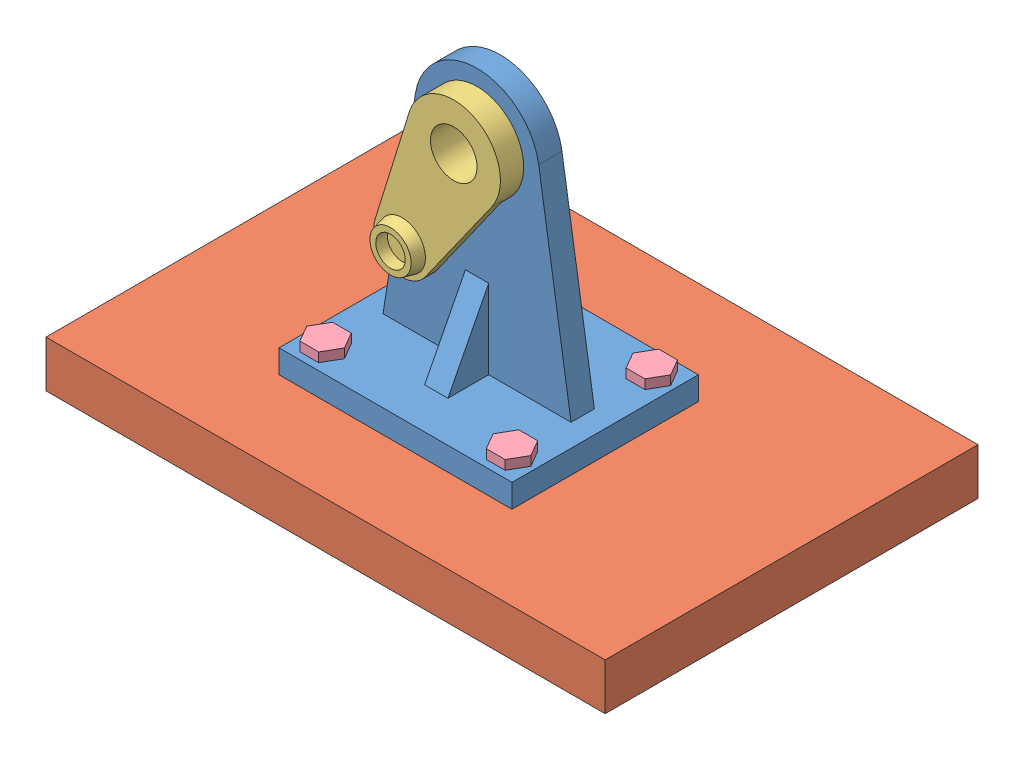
SolidWorks assembly Collision Detection.SLDASM, configuration Default (file format 4628). Lengths in mm.
Overall size (152.4 89.81 101.6).
7 component instances, 4 part files, 15 mates.
Components (placement in the parent):
- Swing Bracket-1: Swing Bracket.SLDPRT [Default] at origin size (63.5 77.1 50.8)
- Base Plate-1: Base Plate.SLDPRT [Default] at (-72.39 -12.7 -53.34) size (152.4 12.7 101.6)
- Swing Arm-1: Swing Arm.SLDPRT [Default] at (0 60.1017 -6.35) x (0.896574 -0.442893 0) z (0 0 1) size (25.4 52.18 19.05)
- Bolts-1: Bolts.SLDPRT [Default] at (0 6.35 0) x (-1 0 0) z (0 1 0) size (10.27 8.89 15.24)
- Bolts-2: Bolts.SLDPRT [Default] at (50.8 6.35 -38.1) x (-1 0 0) z (0 1 0) size (10.27 8.89 15.24)
- Bolts-3: Bolts.SLDPRT [Default] at (0 6.35 -38.1) x (-1 0 0) z (0 1 0) size (10.27 8.89 15.24)
- Bolts-4: Bolts.SLDPRT [Default] at (50.8 6.35 0) x (-1 0 0) z (0 1 0) size (10.27 8.89 15.24)
Mates (geometry in assembly coordinates):
- Concentric3: concentric anti-aligned: cylinder of Swing Bracket-1 through (0 60.1017 -25.4) axis (0 0 1) radius 7.9375; cylinder of Swing Arm-1 through (0 60.1017 0) axis (0 0 -1) radius 7.9375
- Coincident2: coincident anti-aligned: plane of Swing Bracket-1 through (0 60.1017 0) normal (0 0 1); plane of Swing Arm-1 through (0 60.1017 0) normal (0 0 -1)
- Coincident3: coincident anti-aligned: plane of Swing Bracket-1 through (-31.75 0 25.4) normal (0 -1 0); plane of Base Plate-1 through (-72.39 0 48.26) normal (0 1 0)
- Distance1: distance = 22.86 mm aligned: plane of Swing Bracket-1 through (-31.75 6.35 25.4) normal (0 0 1); plane of Base Plate-1 through (-72.39 0 48.26) normal (0 0 1)
- Distance2: distance = 48.26 mm aligned: plane of Swing Bracket-1 through (31.75 6.35 -25.4) normal (1 0 0); plane of Base Plate-1 through (80.01 -12.7 48.26) normal (1 0 0)
- Inplace1: in place: plane of Swing Bracket-1; plane of Bolts-1; moOrthogonalPlaneRef_w of Swing Bracket-1; plane of Bolts-1; moOrthogonalPlaneRef_w of Swing Bracket-1; plane of Bolts-1
- Coincident4: coincident aligned: plane of Swing Bracket-1; plane of Bolts-1
- Coincident5: coincident aligned: moOrthogonalPlaneRef_w of Swing Bracket-1; plane of Bolts-1
- Coincident6: coincident anti-aligned: moOrthogonalPlaneRef_w of Swing Bracket-1; plane of Bolts-1
- Concentric4: concentric aligned: cylinder of Swing Bracket-1 through (25.4 0 19.05) axis (0 1 0) radius 2.54; cylinder of Bolts-4 through (25.4 -6.35 19.05) axis (0 1 0) radius 2.54
- Coincident7: coincident anti-aligned: plane of Swing Bracket-1 through (-31.75 6.35 25.4) normal (0 1 0); plane of Bolts-4 through (20.2674 6.35 19.05) normal (0 -1 0)
- Concentric5: concentric aligned: cylinder of Swing Bracket-1 through (-25.4 0 -19.05) axis (0 1 0) radius 2.54; cylinder of Bolts-3 through (-25.4 -6.35 -19.05) axis (0 1 0) radius 2.54
- Coincident8: coincident anti-aligned: plane of Swing Bracket-1 through (-31.75 6.35 25.4) normal (0 1 0); plane of Bolts-3 through (-30.5326 6.35 -19.05) normal (0 -1 0)
- Concentric6: concentric aligned: cylinder of Swing Bracket-1 through (25.4 0 -19.05) axis (0 1 0) radius 2.54; cylinder of Bolts-2 through (25.4 -6.35 -19.05) axis (0 1 0) radius 2.54
- Coincident9: coincident anti-aligned: plane of Swing Bracket-1 through (-31.75 6.35 25.4) normal (0 1 0); plane of Bolts-2 through (20.2674 6.35 -19.05) normal (0 -1 0)
